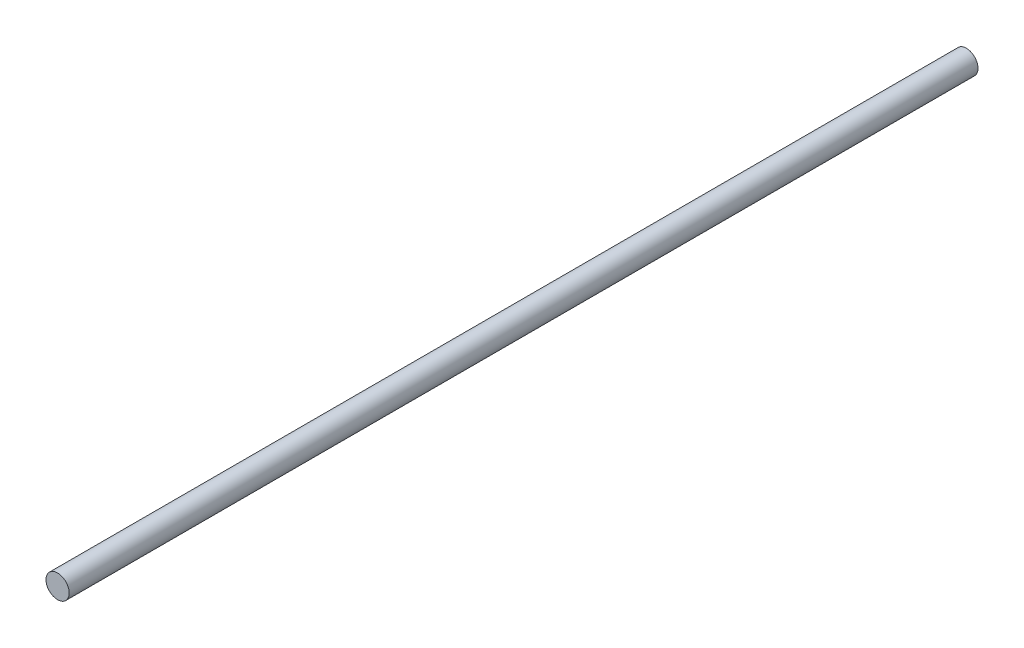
from build123d import *

# Parameters (mm, degrees)
SKETCH1_R           = 30
BOSS_EXTRUDE1_DEPTH = 2350


with BuildPart() as part:
    # Sketch1 → Boss-Extrude1 (new body)
    with BuildSketch(Plane.XY):
        Circle(SKETCH1_R)
    extrude(amount=-BOSS_EXTRUDE1_DEPTH)


solid = part.part
